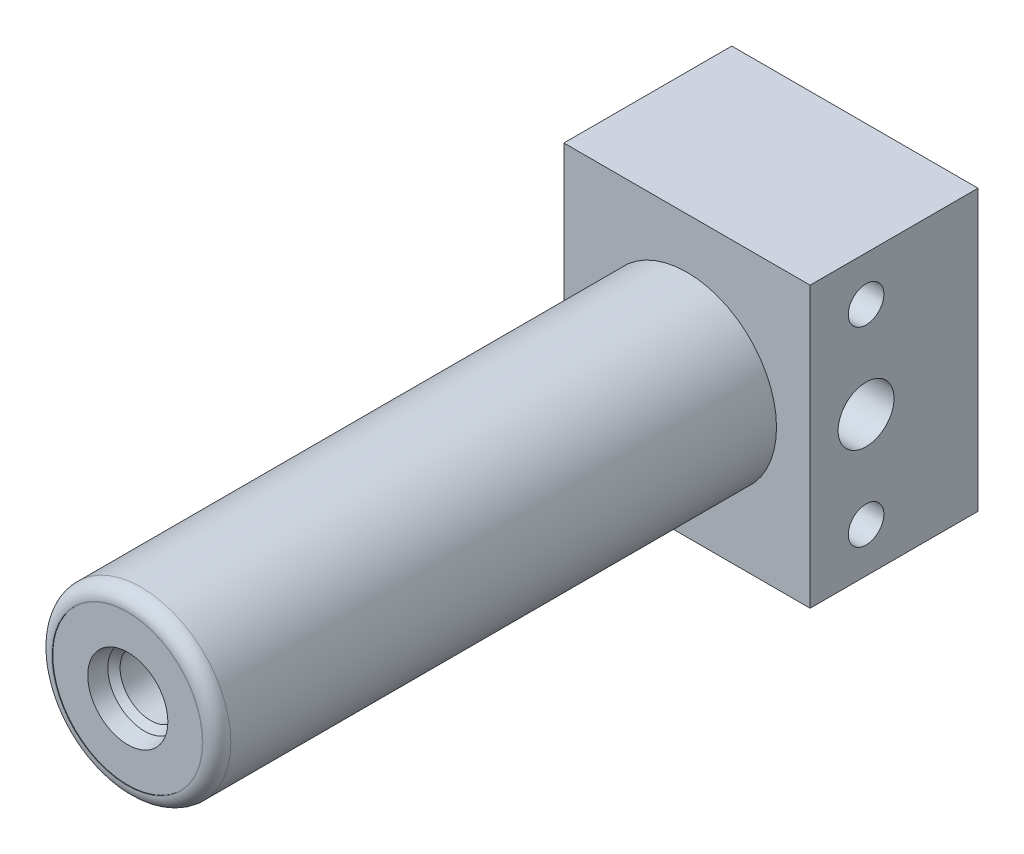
from build123d import *

# Parameters (mm, degrees)
SKETCH1_W                  = 27.94
SKETCH1_H                  = 31.75
BASE_DEPTH                 = 19.05
SKETCH2_R                  = 10.16
CYLINDER_DEPTH             = 63.5
SKETCH3_R                  = 5.715
BORE_DEPTH                 = 60.96
SKETCH4_R                  = 7.1374
ORING_BORE_DEPTH           = 8.128
SKETCH6_R                  = 2.38125
SIDE_PORT_DEPTH            = 15.24
SKETCH7_R                  = 3.175
SIDE_WELD_DEPTH            = 7.62
SKETCH8_R                  = 3.175
CENTER_HOLE_DEPTH          = 8.89
FILLET1_R                  = 1.5875
SKETCH21_R                 = 3.4544
THRU_HOLE_DEPTH            = 25.4
SKETCH31_R                 = 8.509
LAND_DEPTH                 = 0.0508
SKETCH41_R                 = 4.5466
F_12_DEG_CHAMFER_DEPTH     = 1.8796
F_12_DEG_CHAMFER_DRAFT     = -12
SKETCH51_R                 = 4.1529
F_45_DEG_CHAMFER_DEPTH     = 2.54
F_45_DEG_CHAMFER_DRAFT     = -45
CHAMFER1_SIZE              = 1.016
CHAMFER1_SIZE2             = 0.27223638
SKETCH53_R                 = 2.38125
UPPER_SIDE_PORT_DEPTH      = 15.24
SKETCH54_R                 = 3.175
UPPER_SIDE_WELL_DEPTH      = 7.62
F_10_32_TAPPED_HOLE2_D     = 4.0386
F_10_32_TAPPED_HOLE2_DEPTH = 6.35
F_10_32_TAPPED_HOLE2_TIP   = 1.213317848
F_10_32_TAPPED_HOLE3_D     = 4.0386
F_10_32_TAPPED_HOLE3_DEPTH = 12.7
F_10_32_TAPPED_HOLE3_TIP   = 1.213317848


with BuildPart() as part:
    # Sketch1 → base (new body)
    with BuildSketch(Plane.XY):
        Rectangle(SKETCH1_W, SKETCH1_H)
    extrude(amount=BASE_DEPTH)

    # Sketch2 → cylinder (add)
    with BuildSketch(Plane.XY.offset(19.05)):
        Circle(SKETCH2_R)
    extrude(amount=CYLINDER_DEPTH)

    # Sketch3 → bore (cut)
    with BuildSketch(Plane(origin=(0, 0, 0), x_dir=(-1, 0, 0), z_dir=(0, 0, -1))):
        Circle(SKETCH3_R)
    extrude(amount=-BORE_DEPTH, mode=Mode.SUBTRACT)

    # Sketch4 → oring_bore (cut)
    with BuildSketch(Plane(origin=(0, 0, 0), x_dir=(-1, 0, 0), z_dir=(0, 0, -1))):
        Circle(SKETCH4_R)
    extrude(amount=-ORING_BORE_DEPTH, mode=Mode.SUBTRACT)

    # Sketch6 → side_port (cut)
    with BuildSketch(Plane.ZY.offset(13.97)):
        with Locations((66.04, 0)):
            Circle(SKETCH6_R)
    extrude(amount=-SIDE_PORT_DEPTH, mode=Mode.SUBTRACT)

    # Sketch7 → side_weld (cut)
    with BuildSketch(Plane.ZY.offset(13.97)):
        with Locations((66.04, 0)):
            Circle(SKETCH7_R)
    extrude(amount=-SIDE_WELD_DEPTH, mode=Mode.SUBTRACT)

    # Sketch8 → center_hole (cut)
    with BuildSketch(Plane(origin=(0, 0, 60.96), x_dir=(-1, 0, 0), z_dir=(0, 0, -1))):
        Circle(SKETCH8_R)
    extrude(amount=-CENTER_HOLE_DEPTH, mode=Mode.SUBTRACT)

    # Fillet1
    fillet1_edges = [part.edges().sort_by_distance(p)[0] for p in [
        (-10.16, 0, 82.55),
    ]]
    fillet(fillet1_edges, radius=FILLET1_R)

    # Sketch21 → thru_hole (cut)
    with BuildSketch(Plane(origin=(3.80842627, 0.224025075, 82.55), x_dir=(1, 0, 0), z_dir=(0, 0, 1))):
        with Locations((-3.80842627, -0.224025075)):
            Circle(SKETCH21_R)
    extrude(amount=-THRU_HOLE_DEPTH, mode=Mode.SUBTRACT)

    # Sketch31 → land (cut)
    with BuildSketch(Plane.XY.offset(82.55)):
        Circle(SKETCH31_R)
    extrude(amount=-LAND_DEPTH, mode=Mode.SUBTRACT)


with BuildPart() as f_12_deg_chamfer_tool:
    # Sketch41 → 12_deg_chamfer (with draft: the straight prism first)
    with BuildSketch(Plane.XY.offset(82.4992)):
        Circle(SKETCH41_R)
    extrude(amount=-F_12_DEG_CHAMFER_DEPTH)
    # 12_deg_chamfer: the draft: its side faces are tilted about the plane it starts from
    f_12_deg_chamfer_sides = [f_12_deg_chamfer_tool.faces().sort_by_distance(p)[0] for p in [
        (-4.5466, 0, 81.5594),
    ]]
    draft(f_12_deg_chamfer_sides, Plane.XY.offset(82.4992), F_12_DEG_CHAMFER_DRAFT)


with BuildPart() as part_1:
    add(part.part)

    # 12_deg_chamfer: cut by f_12_deg_chamfer_tool
    add(f_12_deg_chamfer_tool.part, mode=Mode.SUBTRACT)


with BuildPart() as f_45_deg_chamfer_tool:
    # Sketch51 → 45_deg_chamfer (with draft: the straight prism first)
    with BuildSketch(Plane.XY.offset(80.6196)):
        Circle(SKETCH51_R)
    extrude(amount=-F_45_DEG_CHAMFER_DEPTH)
    # 45_deg_chamfer: the draft: its side faces are tilted about the plane it starts from
    f_45_deg_chamfer_sides = [f_45_deg_chamfer_tool.faces().sort_by_distance(p)[0] for p in [
        (-4.1529, 0, 79.3496),
    ]]
    draft(f_45_deg_chamfer_sides, Plane.XY.offset(80.6196), F_45_DEG_CHAMFER_DRAFT)


with BuildPart() as part_2:
    add(part_1.part)

    # 45_deg_chamfer: cut by f_45_deg_chamfer_tool
    add(f_45_deg_chamfer_tool.part, mode=Mode.SUBTRACT)

    # Chamfer1
    chamfer1_edges = [part_2.edges().sort_by_distance(p)[0] for p in [
        (7.1374, 0, 0),
    ]]
    chamfer1_side = [part_2.faces().sort_by_distance(p)[0] for p in [
        (7.1374, 0, 4.064),
    ]]
    chamfer(chamfer1_edges, length=CHAMFER1_SIZE, length2=CHAMFER1_SIZE2, reference=chamfer1_side[0])

    # Sketch53 → upper_side_port (cut)
    with BuildSketch(Plane(origin=(13.97, 0, 0), x_dir=(0, 0, -1), z_dir=(1, 0, 0))):
        with Locations((-12.7, 0)):
            Circle(SKETCH53_R)
    extrude(amount=-UPPER_SIDE_PORT_DEPTH, mode=Mode.SUBTRACT)

    # Sketch54 → upper_side_well (cut)
    with BuildSketch(Plane(origin=(13.97, 0, 0), x_dir=(0, 0, -1), z_dir=(1, 0, 0))):
        with Locations((-12.7, 0)):
            Circle(SKETCH54_R)
    extrude(amount=-UPPER_SIDE_WELL_DEPTH, mode=Mode.SUBTRACT)

    # 10-32 Tapped Hole2
    with Locations(Plane(origin=(0, 0, 0), x_dir=(-1, 0, 0), z_dir=(0, 0, -1))):
        with Locations((8.980256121, 8.980256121), (8.980256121, -8.980256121), (-8.980256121, -8.980256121), (-8.980256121, 8.980256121)):
            Hole(F_10_32_TAPPED_HOLE2_D / 2, depth=F_10_32_TAPPED_HOLE2_DEPTH)
            with Locations((0, 0, -(F_10_32_TAPPED_HOLE2_DEPTH + F_10_32_TAPPED_HOLE2_TIP / 2))):  # 118° drill point
                Cone(0, F_10_32_TAPPED_HOLE2_D / 2, F_10_32_TAPPED_HOLE2_TIP, mode=Mode.SUBTRACT)

    # 10-32 Tapped Hole3
    with Locations(Plane(origin=(13.97, 0, 0), x_dir=(0, 0, -1), z_dir=(1, 0, 0))):
        with Locations((-12.7, 10.81405), (-12.7, -10.81405)):
            Hole(F_10_32_TAPPED_HOLE3_D / 2, depth=F_10_32_TAPPED_HOLE3_DEPTH)
            with Locations((0, 0, -(F_10_32_TAPPED_HOLE3_DEPTH + F_10_32_TAPPED_HOLE3_TIP / 2))):  # 118° drill point
                Cone(0, F_10_32_TAPPED_HOLE3_D / 2, F_10_32_TAPPED_HOLE3_TIP, mode=Mode.SUBTRACT)


solid = part_2.part
